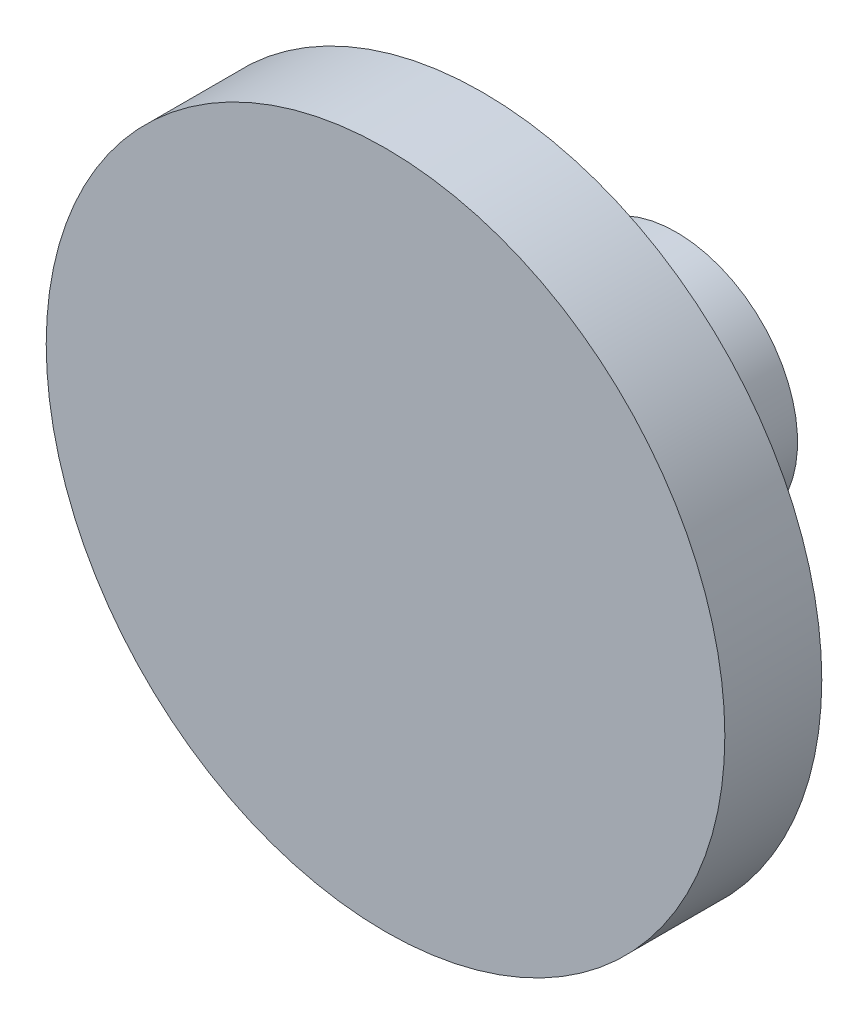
ISO-10303-21;
HEADER;
FILE_DESCRIPTION(('STEP AP214'),'2;1');
FILE_NAME('part.step','',(''),(''),'','','');
FILE_SCHEMA(('AUTOMOTIVE_DESIGN { 1 0 10303 214 1 1 1 1 }'));
ENDSEC;
DATA;
#1=APPLICATION_CONTEXT('core data for automotive mechanical design processes');
#2=APPLICATION_PROTOCOL_DEFINITION('international standard','automotive_design',2000,#1);
#3=PRODUCT_CONTEXT('',#1,'mechanical');
#4=PRODUCT('Part','Part','',(#3));
#5=PRODUCT_RELATED_PRODUCT_CATEGORY('part','',(#4));
#6=PRODUCT_DEFINITION_FORMATION('','',#4);
#7=PRODUCT_DEFINITION_CONTEXT('part definition',#1,'design');
#8=PRODUCT_DEFINITION('design','',#6,#7);
#9=PRODUCT_DEFINITION_SHAPE('','',#8);
#10=(LENGTH_UNIT() NAMED_UNIT(*) SI_UNIT(.MILLI.,.METRE.));
#11=(NAMED_UNIT(*) PLANE_ANGLE_UNIT() SI_UNIT($,.RADIAN.));
#12=(NAMED_UNIT(*) SI_UNIT($,.STERADIAN.) SOLID_ANGLE_UNIT());
#13=UNCERTAINTY_MEASURE_WITH_UNIT(LENGTH_MEASURE(1.E-05),#10,'distance_accuracy_value','');
#14=(GEOMETRIC_REPRESENTATION_CONTEXT(3) GLOBAL_UNCERTAINTY_ASSIGNED_CONTEXT((#13)) GLOBAL_UNIT_ASSIGNED_CONTEXT((#10,
#11,#12)) REPRESENTATION_CONTEXT('',''));
#15=CARTESIAN_POINT('',(0.,0.,0.));
#16=DIRECTION('',(0.,0.,1.));
#17=DIRECTION('',(1.,0.,0.));
#18=AXIS2_PLACEMENT_3D('',#15,#16,#17);
#19=CARTESIAN_POINT('',(0.,0.,-3.));
#20=DIRECTION('',(0.,0.,-1.));
#21=DIRECTION('',(-1.,0.,0.));
#22=AXIS2_PLACEMENT_3D('',#19,#20,#21);
#23=CYLINDRICAL_SURFACE('',#22,21.);
#24=CARTESIAN_POINT('',(0.,0.,-3.));
#25=DIRECTION('',(0.,0.,-1.));
#26=DIRECTION('',(-1.,0.,0.));
#27=AXIS2_PLACEMENT_3D('',#24,#25,#26);
#28=CIRCLE('',#27,21.);
#29=CARTESIAN_POINT('',(-21.,0.,-3.));
#30=VERTEX_POINT('',#29);
#31=EDGE_CURVE('E46',#30,#30,#28,.T.);
#32=ORIENTED_EDGE('',*,*,#31,.T.);
#33=EDGE_LOOP('',(#32));
#34=FACE_BOUND('',#33,.T.);
#35=CARTESIAN_POINT('',(0.,0.,-9.));
#36=DIRECTION('',(0.,0.,-1.));
#37=DIRECTION('',(-1.,0.,0.));
#38=AXIS2_PLACEMENT_3D('',#35,#36,#37);
#39=CIRCLE('',#38,21.);
#40=CARTESIAN_POINT('',(-21.,0.,-9.));
#41=VERTEX_POINT('',#40);
#42=EDGE_CURVE('E50',#41,#41,#39,.T.);
#43=ORIENTED_EDGE('',*,*,#42,.F.);
#44=EDGE_LOOP('',(#43));
#45=FACE_BOUND('',#44,.T.);
#46=ADVANCED_FACE('F35',(#34,#45),#23,.T.);
#47=CARTESIAN_POINT('',(21.,0.,-3.));
#48=DIRECTION('',(0.,0.,1.));
#49=DIRECTION('',(1.,0.,0.));
#50=AXIS2_PLACEMENT_3D('',#47,#48,#49);
#51=PLANE('',#50);
#52=ORIENTED_EDGE('',*,*,#31,.F.);
#53=EDGE_LOOP('',(#52));
#54=FACE_BOUND('',#53,.T.);
#55=ADVANCED_FACE('F75',(#54),#51,.T.);
#56=CARTESIAN_POINT('',(0.,0.,-9.));
#57=DIRECTION('',(0.,0.,-1.));
#58=DIRECTION('',(-1.,0.,0.));
#59=AXIS2_PLACEMENT_3D('',#56,#57,#58);
#60=PLANE('',#59);
#61=CARTESIAN_POINT('',(0.,0.,-9.));
#62=DIRECTION('',(0.,0.,-1.));
#63=DIRECTION('',(-1.,0.,0.));
#64=AXIS2_PLACEMENT_3D('',#61,#62,#63);
#65=CIRCLE('',#64,7.5);
#66=CARTESIAN_POINT('',(-7.5,0.,-9.));
#67=VERTEX_POINT('',#66);
#68=EDGE_CURVE('E87',#67,#67,#65,.T.);
#69=ORIENTED_EDGE('',*,*,#68,.F.);
#70=EDGE_LOOP('',(#69));
#71=FACE_BOUND('',#70,.T.);
#72=ORIENTED_EDGE('',*,*,#42,.T.);
#73=EDGE_LOOP('',(#72));
#74=FACE_BOUND('',#73,.T.);
#75=ADVANCED_FACE('F71',(#71,#74),#60,.T.);
#76=CARTESIAN_POINT('',(0.,0.,-21.));
#77=DIRECTION('',(0.,0.,1.));
#78=DIRECTION('',(1.,0.,0.));
#79=AXIS2_PLACEMENT_3D('',#76,#77,#78);
#80=CYLINDRICAL_SURFACE('',#79,7.5);
#81=CARTESIAN_POINT('',(-4.10844225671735,6.27460773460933,-16.4753175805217));
#82=CARTESIAN_POINT('',(-4.10844150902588,6.2746079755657,-16.3391471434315));
#83=CARTESIAN_POINT('',(-4.11837154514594,6.26813976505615,-16.2029805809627));
#84=CARTESIAN_POINT('',(-4.15741407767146,6.24231075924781,-15.934681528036));
#85=CARTESIAN_POINT('',(-4.1865297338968,6.22294784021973,-15.8025497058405));
#86=CARTESIAN_POINT('',(-4.26202110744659,6.17148594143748,-15.5462503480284));
#87=CARTESIAN_POINT('',(-4.30836299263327,6.13941191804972,-15.4220677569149));
#88=CARTESIAN_POINT('',(-4.41572673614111,6.06264767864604,-15.1844174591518));
#89=CARTESIAN_POINT('',(-4.47675183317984,6.01795467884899,-15.0709521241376));
#90=CARTESIAN_POINT('',(-4.6129033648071,5.9142779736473,-14.8535176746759));
#91=CARTESIAN_POINT('',(-4.68845367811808,5.85484305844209,-14.7500290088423));
#92=CARTESIAN_POINT('',(-4.84867379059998,5.72285963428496,-14.5598005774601));
#93=CARTESIAN_POINT('',(-4.93334505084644,5.65030902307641,-14.4730635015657));
#94=CARTESIAN_POINT('',(-5.11055287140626,5.49061206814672,-14.3166203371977));
#95=CARTESIAN_POINT('',(-5.20323700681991,5.40313429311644,-14.2474176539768));
#96=CARTESIAN_POINT('',(-5.39055772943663,5.21625896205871,-14.1313386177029));
#97=CARTESIAN_POINT('',(-5.48519378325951,5.1168646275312,-14.0844562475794));
#98=CARTESIAN_POINT('',(-5.66931336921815,4.91194358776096,-14.0159779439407));
#99=CARTESIAN_POINT('',(-5.75886161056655,4.80675057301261,-13.9935589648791));
#100=CARTESIAN_POINT('',(-5.93299798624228,4.59007969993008,-13.97202684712));
#101=CARTESIAN_POINT('',(-6.017587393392,4.47860346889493,-13.9729077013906));
#102=CARTESIAN_POINT('',(-6.17603019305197,4.25728332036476,-13.9974282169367));
#103=CARTESIAN_POINT('',(-6.25017453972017,4.14754686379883,-14.0201739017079));
#104=CARTESIAN_POINT('',(-6.38990541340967,3.92886191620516,-14.0863000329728));
#105=CARTESIAN_POINT('',(-6.45549136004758,3.81991347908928,-14.1296818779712));
#106=CARTESIAN_POINT('',(-6.57805516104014,3.6048200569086,-14.2363708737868));
#107=CARTESIAN_POINT('',(-6.6349085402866,3.49873074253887,-14.2999324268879));
#108=CARTESIAN_POINT('',(-6.73877449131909,3.2942510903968,-14.4449668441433));
#109=CARTESIAN_POINT('',(-6.78578431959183,3.19586290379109,-14.5264446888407));
#110=CARTESIAN_POINT('',(-6.87223172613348,3.00563866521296,-14.7095035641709));
#111=CARTESIAN_POINT('',(-6.91120858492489,2.91432919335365,-14.8118504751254));
#112=CARTESIAN_POINT('',(-6.97932126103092,2.74722365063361,-15.0314393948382));
#113=CARTESIAN_POINT('',(-7.00845556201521,2.67142997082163,-15.1486836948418));
#114=CARTESIAN_POINT('',(-7.0579729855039,2.53775322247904,-15.3969516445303));
#115=CARTESIAN_POINT('',(-7.07822542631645,2.48014089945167,-15.5281479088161));
#116=CARTESIAN_POINT('',(-7.11004361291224,2.38740690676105,-15.7992460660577));
#117=CARTESIAN_POINT('',(-7.1216129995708,2.35227581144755,-15.9391442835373));
#118=CARTESIAN_POINT('',(-7.1361982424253,2.30764043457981,-16.2169134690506));
#119=CARTESIAN_POINT('',(-7.13957645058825,2.29705148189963,-16.3545911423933));
#120=CARTESIAN_POINT('',(-7.13897266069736,2.29892885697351,-16.6297579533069));
#121=CARTESIAN_POINT('',(-7.13499199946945,2.31139099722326,-16.7672471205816));
#122=CARTESIAN_POINT('',(-7.11978598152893,2.35779597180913,-17.0332099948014));
#123=CARTESIAN_POINT('',(-7.10881418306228,2.39098622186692,-17.1618311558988));
#124=CARTESIAN_POINT('',(-7.07949811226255,2.47643550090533,-17.4116765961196));
#125=CARTESIAN_POINT('',(-7.06115253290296,2.52869791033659,-17.5328995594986));
#126=CARTESIAN_POINT('',(-7.01584653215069,2.65185229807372,-17.7687686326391));
#127=CARTESIAN_POINT('',(-6.98863132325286,2.72328258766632,-17.8830841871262));
#128=CARTESIAN_POINT('',(-6.92511633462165,2.88096812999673,-18.0981827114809));
#129=CARTESIAN_POINT('',(-6.88881387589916,2.96722775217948,-18.1989616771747));
#130=CARTESIAN_POINT('',(-6.80453083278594,3.15587050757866,-18.3891375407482));
#131=CARTESIAN_POINT('',(-6.75607242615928,3.25882970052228,-18.4777535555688));
#132=CARTESIAN_POINT('',(-6.64810675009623,3.47377608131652,-18.6351079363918));
#133=CARTESIAN_POINT('',(-6.58859987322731,3.5857629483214,-18.7038470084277));
#134=CARTESIAN_POINT('',(-6.45914949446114,3.81398282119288,-18.8188678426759));
#135=CARTESIAN_POINT('',(-6.38927795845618,3.93018267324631,-18.8652957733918));
#136=CARTESIAN_POINT('',(-6.23984251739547,4.16335277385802,-18.9346369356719));
#137=CARTESIAN_POINT('',(-6.16028212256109,4.28032272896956,-18.9575586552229));
#138=CARTESIAN_POINT('',(-5.99738888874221,4.50552264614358,-18.9784727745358));
#139=CARTESIAN_POINT('',(-5.91440910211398,4.61390500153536,-18.9775862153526));
#140=CARTESIAN_POINT('',(-5.74393107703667,4.82447962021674,-18.9536743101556));
#141=CARTESIAN_POINT('',(-5.65643320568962,4.92667238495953,-18.9306507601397));
#142=CARTESIAN_POINT('',(-5.4813094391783,5.12074979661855,-18.8638619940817));
#143=CARTESIAN_POINT('',(-5.39370765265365,5.21277239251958,-18.8204320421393));
#144=CARTESIAN_POINT('',(-5.22006539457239,5.38665314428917,-18.7143737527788));
#145=CARTESIAN_POINT('',(-5.13402520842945,5.46850945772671,-18.6517419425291));
#146=CARTESIAN_POINT('',(-4.96351388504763,5.62381773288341,-18.5063938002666));
#147=CARTESIAN_POINT('',(-4.87921818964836,5.6968474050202,-18.4230208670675));
#148=CARTESIAN_POINT('',(-4.71903180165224,5.83023362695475,-18.2396741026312));
#149=CARTESIAN_POINT('',(-4.6431438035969,5.89058611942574,-18.1396949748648));
#150=CARTESIAN_POINT('',(-4.50037346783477,6.00042329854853,-17.9212941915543));
#151=CARTESIAN_POINT('',(-4.43395994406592,6.04939008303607,-17.80230380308));
#152=CARTESIAN_POINT('',(-4.31742110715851,6.13311087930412,-17.5519815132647));
#153=CARTESIAN_POINT('',(-4.26729153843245,6.16786860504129,-17.4206528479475));
#154=CARTESIAN_POINT('',(-4.18825988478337,6.22179053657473,-17.1554130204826));
#155=CARTESIAN_POINT('',(-4.15850070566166,6.2415885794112,-17.0218869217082));
#156=CARTESIAN_POINT('',(-4.11859565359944,6.26799478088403,-16.7506774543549));
#157=CARTESIAN_POINT('',(-4.10844301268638,6.27460749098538,-16.6129955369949));
#158=CARTESIAN_POINT('',(-4.10844225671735,6.27460773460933,-16.4753175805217));
#159=B_SPLINE_CURVE_WITH_KNOTS('',3,(#81,#82,#83,#84,#85,#86,#87,#88,#89,#90,#91,#92,#93,#94,
#95,#96,#97,#98,#99,#100,#101,#102,#103,#104,#105,#106,#107,#108,#109,#110,#111,#112,#113,#114,
#115,#116,#117,#118,#119,#120,#121,#122,#123,#124,#125,#126,#127,#128,#129,#130,#131,#132,#133,
#134,#135,#136,#137,#138,#139,#140,#141,#142,#143,#144,#145,#146,#147,#148,#149,#150,#151,#152,
#153,#154,#155,#156,#157,#158),.UNSPECIFIED.,.T.,.F.,(4,2,2,2,2,2,2,2,2,2,2,2,2,2,2,2,2,2,2,2,2,
2,2,2,2,2,2,2,2,2,2,2,2,2,2,2,2,2,4),(0.,0.40800146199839,0.816070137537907,1.22334156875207,
1.6307029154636,2.0525334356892,2.47443162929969,2.90733765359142,3.34012690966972,
3.75785796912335,4.17548133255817,4.57672512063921,4.9779961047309,5.38454137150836,
5.79119979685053,6.21700435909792,6.64287449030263,7.07481599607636,7.50657628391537,
7.91885728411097,8.33106339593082,8.72910989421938,9.12722697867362,9.53797144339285,
9.94883714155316,10.3794702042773,10.8100879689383,11.2378447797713,11.6654470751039,
12.0729521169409,12.4804241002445,12.8814239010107,13.282496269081,13.6983879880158,
14.1144126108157,14.5467225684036,14.9789194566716,15.3915803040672,15.8040986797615),.UNSPECIFIED.);
#160=CARTESIAN_POINT('',(-4.10844225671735,6.27460773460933,-16.4753175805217));
#161=VERTEX_POINT('',#160);
#162=EDGE_CURVE('E38',#161,#161,#159,.T.);
#163=ORIENTED_EDGE('',*,*,#162,.T.);
#164=EDGE_LOOP('',(#163));
#165=FACE_BOUND('',#164,.T.);
#166=CARTESIAN_POINT('',(7.13929302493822,-2.29793278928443,-16.4753175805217));
#167=CARTESIAN_POINT('',(7.13929305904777,-2.29793200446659,-16.6114880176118));
#168=CARTESIAN_POINT('',(7.13568890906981,-2.30922153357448,-16.7476545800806));
#169=CARTESIAN_POINT('',(7.12113493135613,-2.35371466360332,-17.0159536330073));
#170=CARTESIAN_POINT('',(7.11018389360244,-2.38692187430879,-17.1480854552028));
#171=CARTESIAN_POINT('',(7.0805774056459,-2.47335526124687,-17.4043848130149));
#172=CARTESIAN_POINT('',(7.06193704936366,-2.52654219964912,-17.5285674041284));
#173=CARTESIAN_POINT('',(7.01638348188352,-2.65041549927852,-17.7662177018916));
#174=CARTESIAN_POINT('',(6.98946844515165,-2.72110572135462,-17.8796830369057));
#175=CARTESIAN_POINT('',(6.92559751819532,-2.87987159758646,-18.0971174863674));
#176=CARTESIAN_POINT('',(6.88831894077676,-2.96847558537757,-18.200606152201));
#177=CARTESIAN_POINT('',(6.80353515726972,-3.15795333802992,-18.3908345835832));
#178=CARTESIAN_POINT('',(6.75602831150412,-3.25882906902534,-18.4775716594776));
#179=CARTESIAN_POINT('',(6.64902638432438,-3.47203393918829,-18.6340148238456));
#180=CARTESIAN_POINT('',(6.58925085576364,-3.58459324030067,-18.7032175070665));
#181=CARTESIAN_POINT('',(6.45872417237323,-3.8147545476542,-18.8192965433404));
#182=CARTESIAN_POINT('',(6.38797598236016,-3.93235518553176,-18.8661789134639));
#183=CARTESIAN_POINT('',(6.23920065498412,-4.16421410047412,-18.9346572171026));
#184=CARTESIAN_POINT('',(6.16151242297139,-4.27844630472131,-18.9570761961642));
#185=CARTESIAN_POINT('',(5.99876100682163,-4.50379430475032,-18.9786083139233));
#186=CARTESIAN_POINT('',(5.91369972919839,-4.61491089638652,-18.9777274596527));
#187=CARTESIAN_POINT('',(5.74230479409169,-4.82635948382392,-18.9532069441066));
#188=CARTESIAN_POINT('',(5.65615188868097,-4.92694353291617,-18.9304612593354));
#189=CARTESIAN_POINT('',(5.48233703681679,-5.11965113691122,-18.8643351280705));
#190=CARTESIAN_POINT('',(5.39467498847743,-5.21177411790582,-18.8209532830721));
#191=CARTESIAN_POINT('',(5.21977188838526,-5.38697677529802,-18.7142642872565));
#192=CARTESIAN_POINT('',(5.13255151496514,-5.46992167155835,-18.6507027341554));
#193=CARTESIAN_POINT('',(4.96292529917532,-5.62428167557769,-18.5056683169));
#194=CARTESIAN_POINT('',(4.88052080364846,-5.69569356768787,-18.4241904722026));
#195=CARTESIAN_POINT('',(4.72002196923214,-5.82947898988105,-18.2411315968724));
#196=CARTESIAN_POINT('',(4.64231322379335,-5.89126868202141,-18.1387846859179));
#197=CARTESIAN_POINT('',(4.49924500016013,-6.00124632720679,-17.9191957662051));
#198=CARTESIAN_POINT('',(4.4338874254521,-6.04943218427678,-17.8019514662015));
#199=CARTESIAN_POINT('',(4.31812191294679,-6.1326174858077,-17.553683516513));
#200=CARTESIAN_POINT('',(4.26794038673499,-6.16741914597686,-17.4224872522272));
#201=CARTESIAN_POINT('',(4.18696021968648,-6.22268398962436,-17.1513890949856));
#202=CARTESIAN_POINT('',(4.15615345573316,-6.24315318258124,-17.011490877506));
#203=CARTESIAN_POINT('',(4.11698205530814,-6.26905004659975,-16.7337216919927));
#204=CARTESIAN_POINT('',(4.1076676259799,-6.27511466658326,-16.59604401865));
#205=CARTESIAN_POINT('',(4.10931774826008,-6.27403476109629,-16.3208772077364));
#206=CARTESIAN_POINT('',(4.12027861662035,-6.26689263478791,-16.1833880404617));
#207=CARTESIAN_POINT('',(4.1609917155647,-6.23992806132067,-15.9174251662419));
#208=CARTESIAN_POINT('',(4.19008551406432,-6.22054962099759,-15.7888040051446));
#209=CARTESIAN_POINT('',(4.26470498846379,-6.16962864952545,-15.5389585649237));
#210=CARTESIAN_POINT('',(4.31023357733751,-6.13808396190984,-15.4177356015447));
#211=CARTESIAN_POINT('',(4.41696976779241,-6.06174902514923,-15.1818665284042));
#212=CARTESIAN_POINT('',(4.47862886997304,-6.01657039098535,-15.0675509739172));
#213=CARTESIAN_POINT('',(4.61383309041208,-5.91352330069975,-14.8524524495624));
#214=CARTESIAN_POINT('',(4.68738171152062,-5.85565110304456,-14.7516734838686));
#215=CARTESIAN_POINT('',(4.84692945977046,-5.72437187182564,-14.5614976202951));
#216=CARTESIAN_POINT('',(4.93335735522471,-5.65035139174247,-14.4728816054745));
#217=CARTESIAN_POINT('',(5.11198886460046,-5.4892634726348,-14.3155272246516));
#218=CARTESIAN_POINT('',(5.20419227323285,-5.40219649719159,-14.2467881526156));
#219=CARTESIAN_POINT('',(5.38992637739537,-5.21687366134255,-14.1317673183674));
#220=CARTESIAN_POINT('',(5.4834441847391,-5.11869598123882,-14.0853393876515));
#221=CARTESIAN_POINT('',(5.66865303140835,-4.91279083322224,-14.0159982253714));
#222=CARTESIAN_POINT('',(5.76034471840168,-4.80506682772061,-13.9930765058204));
#223=CARTESIAN_POINT('',(5.93430071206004,-4.58829847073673,-13.9721623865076));
#224=CARTESIAN_POINT('',(6.01680555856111,-4.4795541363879,-13.9730489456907));
#225=CARTESIAN_POINT('',(6.1746487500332,-4.2593497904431,-13.9969608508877));
#226=CARTESIAN_POINT('',(6.24998767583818,-4.14788999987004,-14.0199844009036));
#227=CARTESIAN_POINT('',(6.39069232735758,-3.92757981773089,-14.0867731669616));
#228=CARTESIAN_POINT('',(6.45619745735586,-3.81871609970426,-14.130203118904));
#229=CARTESIAN_POINT('',(6.57782092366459,-3.60518886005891,-14.2362614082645));
#230=CARTESIAN_POINT('',(6.63393755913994,-3.5005261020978,-14.2988932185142));
#231=CARTESIAN_POINT('',(6.73848319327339,-3.29494161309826,-14.4442413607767));
#232=CARTESIAN_POINT('',(6.78655152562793,-3.19430100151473,-14.5276142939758));
#233=CARTESIAN_POINT('',(6.8726968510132,-3.00448386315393,-14.7109610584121));
#234=CARTESIAN_POINT('',(6.91077064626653,-2.91531101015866,-14.8109401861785));
#235=CARTESIAN_POINT('',(6.97882685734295,-2.7485299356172,-15.029340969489));
#236=CARTESIAN_POINT('',(7.00843419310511,-2.67151105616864,-15.1483313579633));
#237=CARTESIAN_POINT('',(7.05826292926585,-2.53694668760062,-15.3986536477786));
#238=CARTESIAN_POINT('',(7.07848678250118,-2.47939611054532,-15.5299823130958));
#239=CARTESIAN_POINT('',(7.10952669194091,-2.38889693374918,-15.7952221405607));
#240=CARTESIAN_POINT('',(7.12072667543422,-2.35495386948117,-15.9287482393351));
#241=CARTESIAN_POINT('',(7.13560852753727,-2.3094760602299,-16.1999577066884));
#242=CARTESIAN_POINT('',(7.13929299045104,-2.29793358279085,-16.3376396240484));
#243=CARTESIAN_POINT('',(7.13929302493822,-2.29793278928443,-16.4753175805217));
#244=B_SPLINE_CURVE_WITH_KNOTS('',3,(#166,#167,#168,#169,#170,#171,#172,#173,#174,#175,#176,
#177,#178,#179,#180,#181,#182,#183,#184,#185,#186,#187,#188,#189,#190,#191,#192,#193,#194,#195,
#196,#197,#198,#199,#200,#201,#202,#203,#204,#205,#206,#207,#208,#209,#210,#211,#212,#213,#214,
#215,#216,#217,#218,#219,#220,#221,#222,#223,#224,#225,#226,#227,#228,#229,#230,#231,#232,#233,
#234,#235,#236,#237,#238,#239,#240,#241,#242,#243),.UNSPECIFIED.,.T.,.F.,(4,2,2,2,2,2,2,2,2,2,2,
2,2,2,2,2,2,2,2,2,2,2,2,2,2,2,2,2,2,2,2,2,2,2,2,2,2,2,4),(0.,0.40800146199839,0.816070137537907,
1.22334156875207,1.6307029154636,2.0525334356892,2.47443162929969,2.90733765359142,
3.34012690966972,3.75785796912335,4.17548133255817,4.57672512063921,4.9779961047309,
5.38454137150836,5.79119979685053,6.21700435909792,6.64287449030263,7.07481599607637,
7.50657628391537,7.91885728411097,8.33106339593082,8.72910989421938,9.12722697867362,
9.53797144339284,9.94883714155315,10.3794702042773,10.8100879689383,11.2378447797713,
11.6654470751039,12.0729521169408,12.4804241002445,12.8814239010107,13.282496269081,
13.6983879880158,14.1144126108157,14.5467225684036,14.9789194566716,15.3915803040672,
15.8040986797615),.UNSPECIFIED.);
#245=CARTESIAN_POINT('',(7.13929302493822,-2.29793278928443,-16.4753175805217));
#246=VERTEX_POINT('',#245);
#247=EDGE_CURVE('E10',#246,#246,#244,.T.);
#248=ORIENTED_EDGE('',*,*,#247,.T.);
#249=EDGE_LOOP('',(#248));
#250=FACE_BOUND('',#249,.T.);
#251=CARTESIAN_POINT('',(0.,0.,-21.));
#252=DIRECTION('',(0.,0.,-1.));
#253=DIRECTION('',(-1.,0.,0.));
#254=AXIS2_PLACEMENT_3D('',#251,#252,#253);
#255=CIRCLE('',#254,7.5);
#256=CARTESIAN_POINT('',(-7.5,0.,-21.));
#257=VERTEX_POINT('',#256);
#258=EDGE_CURVE('E86',#257,#257,#255,.T.);
#259=ORIENTED_EDGE('',*,*,#258,.F.);
#260=EDGE_LOOP('',(#259));
#261=FACE_BOUND('',#260,.T.);
#262=ORIENTED_EDGE('',*,*,#68,.T.);
#263=EDGE_LOOP('',(#262));
#264=FACE_BOUND('',#263,.T.);
#265=ADVANCED_FACE('F55',(#165,#250,#261,#264),#80,.T.);
#266=CARTESIAN_POINT('',(0.,0.,-21.));
#267=DIRECTION('',(0.,0.,-1.));
#268=DIRECTION('',(-1.,0.,0.));
#269=AXIS2_PLACEMENT_3D('',#266,#267,#268);
#270=PLANE('',#269);
#271=ORIENTED_EDGE('',*,*,#258,.T.);
#272=EDGE_LOOP('',(#271));
#273=FACE_BOUND('',#272,.T.);
#274=ADVANCED_FACE('F62',(#273),#270,.T.);
#275=CARTESIAN_POINT('',(5.96501241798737,-4.54627615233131,-16.4753175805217));
#276=DIRECTION('',(0.795334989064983,-0.606170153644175,0.));
#277=DIRECTION('',(0.606170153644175,0.795334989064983,0.));
#278=AXIS2_PLACEMENT_3D('',#275,#276,#277);
#279=CYLINDRICAL_SURFACE('',#278,2.49999999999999);
#280=ORIENTED_EDGE('',*,*,#247,.F.);
#281=EDGE_LOOP('',(#280));
#282=FACE_BOUND('',#281,.T.);
#283=ORIENTED_EDGE('',*,*,#162,.F.);
#284=EDGE_LOOP('',(#283));
#285=FACE_BOUND('',#284,.T.);
#286=ADVANCED_FACE('F59',(#282,#285),#279,.F.);
#287=CLOSED_SHELL('',(#46,#55,#75,#265,#274,#286));
#288=MANIFOLD_SOLID_BREP('B2',#287);
#289=ADVANCED_BREP_SHAPE_REPRESENTATION('',(#18,#288),#14);
#290=SHAPE_DEFINITION_REPRESENTATION(#9,#289);
ENDSEC;
END-ISO-10303-21;
